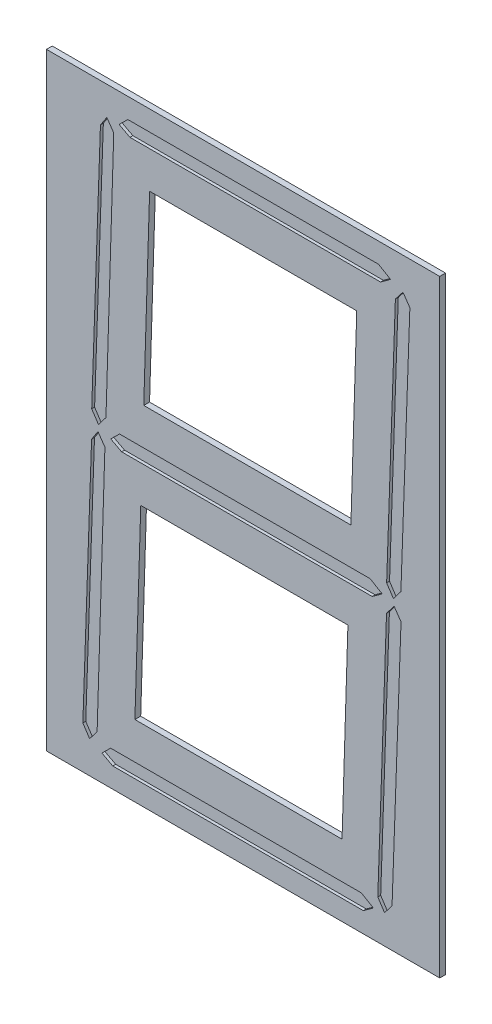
from build123d import *

# Parameters (mm, degrees)
SKETCH1_W               = 406.4
SKETCH1_H               = 609.6
BOSS_EXTRUDE1_DEPTH     = 6
CUT_EXTRUDE1_DEPTH      = 3
SKETCH5_W               = 406.4
SKETCH5_H               = 20.828
BOSS_EXTRUDE2_DEPTH     = 6
CUT_EXTRUDE2_DEPTH      = 174.244
CUT_EXTRUDE2_DEPTH_BACK = 172.624


with BuildPart() as part:
    # Sketch1 → Boss-Extrude1 (new body)
    with BuildSketch(Plane.XY):
        Rectangle(SKETCH1_W, SKETCH1_H)
    extrude(amount=-BOSS_EXTRUDE1_DEPTH)

    # Sketch4 → Cut-Extrude1 (cut)
    with BuildSketch(Plane.XY):
        Polygon((-128.14920138, 275.135709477), (-119.065722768, 284.035024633), (139.898954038, 284.035024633), (152.4, 276.704100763), (142.05684781, 269.191052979), (-116.907828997, 269.191052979), align=None)
        Polygon((-140.849059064, 275.07558621), (-133.668998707, 264.76267408), (-141.721883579, 5.948070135), (-149.456862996, -4.142432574), (-156.459842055, 6.452296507), (-147.431627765, 264.98652761), align=None)
        Polygon((-125.543828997, -16.558947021), (133.42084781, -16.558947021), (143.764, -9.045899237), (131.262954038, -1.714975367), (-127.701722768, -1.714975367), (-136.78520138, -10.614290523), align=None)
        Polygon((153.934116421, -283.159497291), (163.212169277, -24.385916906), (156.081011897, -14.039129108), (148.224372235, -24.121039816), (139.196157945, -282.655270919), (146.199137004, -293.25), align=None)
        Polygon((157.368372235, 261.628960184), (148.340157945, 3.094729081), (155.343137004, -7.5), (163.078116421, 2.590502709), (172.356169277, 261.364083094), (165.225011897, 271.710870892), align=None)
        Polygon((-156.575627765, -20.76347239), (-165.603842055, -279.297703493), (-158.600862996, -289.892432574), (-150.865883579, -279.801929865), (-142.812998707, -20.98732592), (-149.993059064, -10.67441379), align=None)
        Polygon((-136.845722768, -287.464975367), (122.118954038, -287.464975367), (134.62, -294.795899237), (124.27684781, -302.308947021), (-134.687828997, -302.308947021), (-145.92920138, -296.364290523), align=None)
    extrude(amount=-CUT_EXTRUDE1_DEPTH, mode=Mode.SUBTRACT)

    # Sketch5 → Boss-Extrude2 (add)
    with BuildSketch(Plane.XY):
        with Locations((0, -312.722947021)):
            Rectangle(SKETCH5_W, SKETCH5_H)
    extrude(amount=-BOSS_EXTRUDE2_DEPTH)

    # Sketch6 → Cut-Extrude2 (cut, two sides: drawn at the far end of the back side and taken through both)
    with BuildSketch(Plane.XY.offset(-CUT_EXTRUDE2_DEPTH_BACK)):
        Polygon((102.258680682, -249.364975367), (-111.817598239, -249.324641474), (-105.760674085, -54.658947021), (108.315604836, -54.699280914), align=None)
        Polygon((111.402680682, 36.385024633), (-102.674853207, 36.385024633), (-96.616674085, 231.091052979), (117.460859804, 231.091052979), align=None)
    extrude(amount=CUT_EXTRUDE2_DEPTH + CUT_EXTRUDE2_DEPTH_BACK, mode=Mode.SUBTRACT)


solid = part.part
